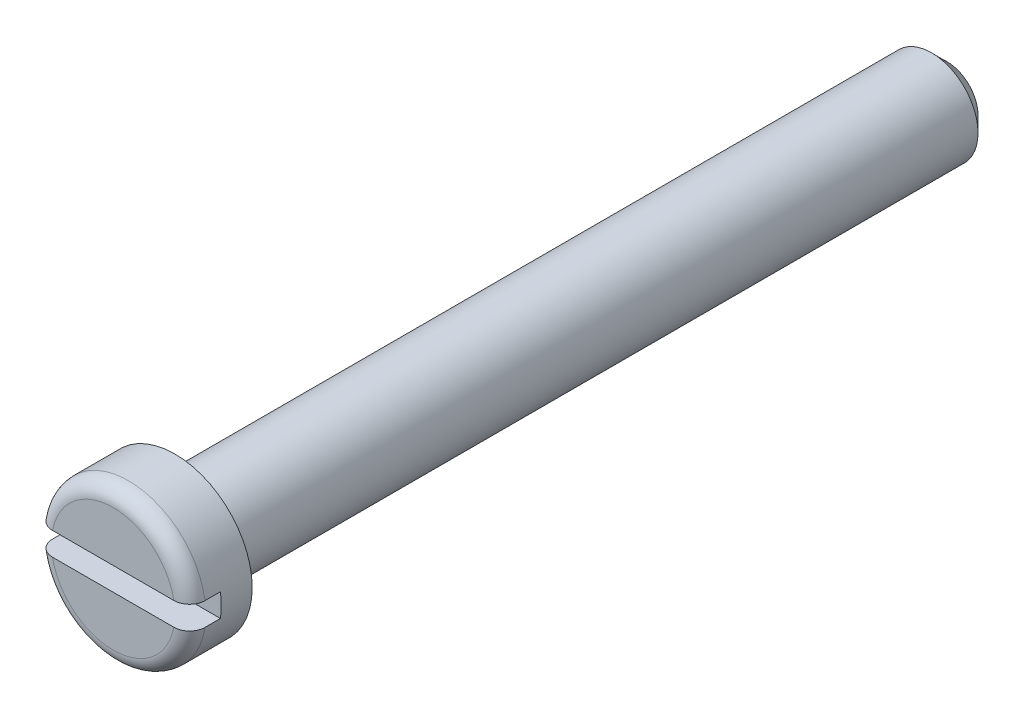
from build123d import *

# Parameters (mm, degrees)
ESQUISSE1_R             = 3
EXTRUSION1_DEPTH        = 50
ESQUISSE2_R             = 5
EXTRUSION2_DEPTH        = 4
ESQUISSE3_W             = 11.574973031
ESQUISSE3_H             = 1.5
ENL_V_MAT_EXTRU_1_DEPTH = 2
CONG_1_R                = 1
CHANFREIN1_SIZE         = 1


with BuildPart() as part:
    # Esquisse1 → Extrusion1 (new body)
    with BuildSketch(Plane.XY):
        Circle(ESQUISSE1_R)
    extrude(amount=EXTRUSION1_DEPTH)

    # Esquisse2 → Extrusion2 (add)
    with BuildSketch(Plane.XY.offset(50)):
        Circle(ESQUISSE2_R)
    extrude(amount=EXTRUSION2_DEPTH)

    # Esquisse3 → Enl_v. mat.-Extru.1 (cut)
    with BuildSketch(Plane.XY.offset(54)):
        with Locations((0.097087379, 0)):
            Rectangle(ESQUISSE3_W, ESQUISSE3_H)
    extrude(amount=-ENL_V_MAT_EXTRU_1_DEPTH, mode=Mode.SUBTRACT)

    # Cong_1
    cong_1_edges = [part.edges().sort_by_distance(p)[0] for p in [
        (0, -5, 54),
        (0, 5, 54),
    ]]
    fillet(cong_1_edges, radius=CONG_1_R)

    # Chanfrein1
    chanfrein1_edges = [part.edges().sort_by_distance(p)[0] for p in [
        (-3, 0, 0),
    ]]
    chamfer(chanfrein1_edges, length=CHANFREIN1_SIZE)


solid = part.part
